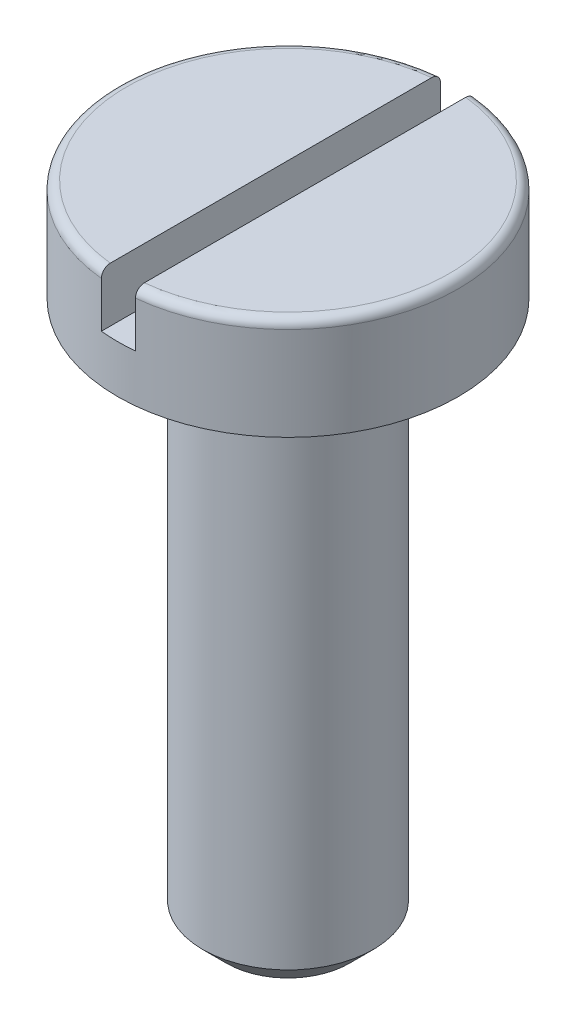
from build123d import *

# Parameters (mm, degrees)
ESQUISSE1_R             = 1.25
BASE_EXTRUSION_DEPTH    = 8
CHANFREIN1_SIZE         = 0.35
ESQUISSE3_W             = 0.5
ESQUISSE3_H             = 5
ENL_V_MAT_EXTRU_1_DEPTH = 0.8


with BuildPart() as part:
    # Esquisse1 → Base-Extrusion (new body)
    with BuildSketch(Plane(origin=(0, 0, 0), x_dir=(1, 0, 0), z_dir=(0, 1, 0))):
        with Locations(Location((0, 0, 0), (0, 0, 270))):
            Circle(ESQUISSE1_R)
    extrude(amount=-BASE_EXTRUSION_DEPTH)

    # Chanfrein1
    chanfrein1_edges = [part.edges().sort_by_distance(p)[0] for p in [
        (0, -8, -1.25),
    ]]
    chamfer(chanfrein1_edges, length=CHANFREIN1_SIZE)

    # Esquisse2 → Boss.-R_vol.1 (revolve)
    with BuildSketch(Plane.XY, mode=Mode.PRIVATE) as boss_r_vol_1_sk:
        with BuildLine():
            Line((0, 1.5), (0, 0))
            Line((0, 0), (2.5, 0))
            Line((2.5, 0), (2.5, 1.37))
            ThreePointArc((2.5, 1.37), (2.461923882, 1.461923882), (2.37, 1.5))
            Line((2.37, 1.5), (0, 1.5))
        make_face()
    revolve(boss_r_vol_1_sk.sketch.rotate(Axis((0, 1.3, 0), (0, -1, 0)), 90), axis=Axis((0, 1.3, 0), (0, -1, 0)))

    # Esquisse3 → Enl_v. mat.-Extru.1 (cut)
    with BuildSketch(Plane(origin=(0, 1.5, 0), x_dir=(-1, 0, 0), z_dir=(0, 1, 0))):
        Rectangle(ESQUISSE3_W, ESQUISSE3_H)
    extrude(amount=-ENL_V_MAT_EXTRU_1_DEPTH, mode=Mode.SUBTRACT)


solid = part.part
